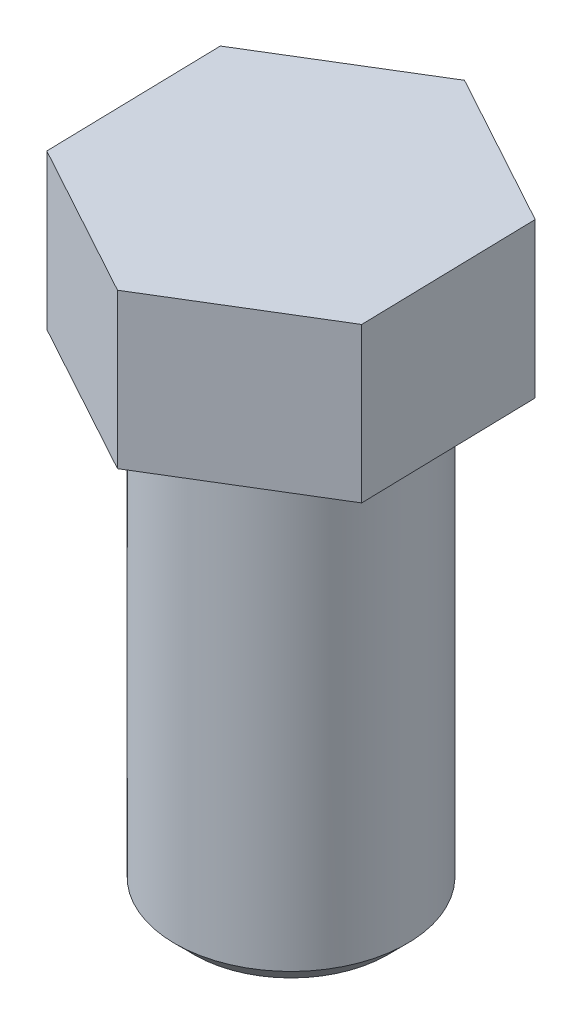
from build123d import *

# Parameters (mm, degrees)
ESQUISSE1_W      = 3
ESQUISSE1_H      = 12
CHANFREIN1_SIZE  = 0.5
EXTRUSION1_DEPTH = 4


with BuildPart() as part:
    # Esquisse1 → Base-R_volution (revolve)
    with BuildSketch(Plane.XY, mode=Mode.PRIVATE) as base_r_volution_sk:
        with Locations((-1.5, 6)):
            Rectangle(ESQUISSE1_W, ESQUISSE1_H)
    revolve(base_r_volution_sk.sketch.rotate(Axis((0, 50, 0), (0, -1, 0)), 270), axis=Axis((0, 50, 0), (0, -1, 0)))

    # Chanfrein1
    chanfrein1_edges = [part.edges().sort_by_distance(p)[0] for p in [
        (0, 0, -3),
    ]]
    chamfer(chanfrein1_edges, length=CHANFREIN1_SIZE)

    # Esquisse2 → Extrusion1 (add)
    with BuildSketch(Plane(origin=(0, 12, 0), x_dir=(-1, 0, 0), z_dir=(0, 1, 0))):
        Polygon((-3.927771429, -2.391771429), (0.107449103, -4.597435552), (4.035220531, -2.205664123), (3.927771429, 2.391771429), (-0.107449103, 4.597435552), (-4.035220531, 2.205664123), align=None)
    extrude(amount=EXTRUSION1_DEPTH)


solid = part.part
